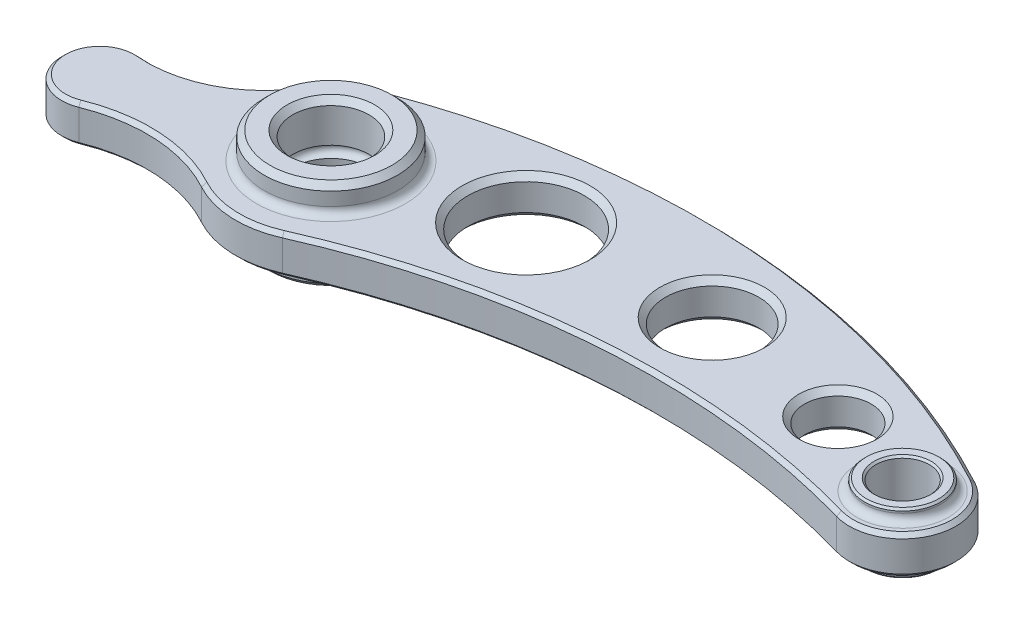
ISO-10303-21;
HEADER;
FILE_DESCRIPTION(('STEP AP214'),'2;1');
FILE_NAME('part.step','',(''),(''),'','','');
FILE_SCHEMA(('AUTOMOTIVE_DESIGN { 1 0 10303 214 1 1 1 1 }'));
ENDSEC;
DATA;
#1=APPLICATION_CONTEXT('core data for automotive mechanical design processes');
#2=APPLICATION_PROTOCOL_DEFINITION('international standard','automotive_design',2000,#1);
#3=PRODUCT_CONTEXT('',#1,'mechanical');
#4=PRODUCT('Part','Part','',(#3));
#5=PRODUCT_RELATED_PRODUCT_CATEGORY('part','',(#4));
#6=PRODUCT_DEFINITION_FORMATION('','',#4);
#7=PRODUCT_DEFINITION_CONTEXT('part definition',#1,'design');
#8=PRODUCT_DEFINITION('design','',#6,#7);
#9=PRODUCT_DEFINITION_SHAPE('','',#8);
#10=(LENGTH_UNIT() NAMED_UNIT(*) SI_UNIT(.MILLI.,.METRE.));
#11=(NAMED_UNIT(*) PLANE_ANGLE_UNIT() SI_UNIT($,.RADIAN.));
#12=(NAMED_UNIT(*) SI_UNIT($,.STERADIAN.) SOLID_ANGLE_UNIT());
#13=UNCERTAINTY_MEASURE_WITH_UNIT(LENGTH_MEASURE(1.E-05),#10,'distance_accuracy_value','');
#14=(GEOMETRIC_REPRESENTATION_CONTEXT(3) GLOBAL_UNCERTAINTY_ASSIGNED_CONTEXT((#13)) GLOBAL_UNIT_ASSIGNED_CONTEXT((#10,
#11,#12)) REPRESENTATION_CONTEXT('',''));
#15=CARTESIAN_POINT('',(0.,0.,0.));
#16=DIRECTION('',(0.,0.,1.));
#17=DIRECTION('',(1.,0.,0.));
#18=AXIS2_PLACEMENT_3D('',#15,#16,#17);
#19=CARTESIAN_POINT('',(0.,5.,0.));
#20=DIRECTION('',(0.,-1.,0.));
#21=DIRECTION('',(0.,0.,-1.));
#22=AXIS2_PLACEMENT_3D('',#19,#20,#21);
#23=CYLINDRICAL_SURFACE('',#22,10.);
#24=CARTESIAN_POINT('',(0.,-10.4999999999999,0.));
#25=DIRECTION('',(0.,1.,0.));
#26=DIRECTION('',(0.,0.,1.));
#27=AXIS2_PLACEMENT_3D('',#24,#25,#26);
#28=CIRCLE('',#27,10.);
#29=CARTESIAN_POINT('',(0.,-10.4999999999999,10.));
#30=VERTEX_POINT('',#29);
#31=EDGE_CURVE('E244',#30,#30,#28,.F.);
#32=ORIENTED_EDGE('',*,*,#31,.T.);
#33=EDGE_LOOP('',(#32));
#34=FACE_BOUND('',#33,.T.);
#35=CARTESIAN_POINT('',(0.,-1.50000000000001,0.));
#36=DIRECTION('',(0.,1.,0.));
#37=DIRECTION('',(0.,0.,1.));
#38=AXIS2_PLACEMENT_3D('',#35,#36,#37);
#39=CIRCLE('',#38,10.);
#40=CARTESIAN_POINT('',(0.,-1.50000000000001,10.));
#41=VERTEX_POINT('',#40);
#42=EDGE_CURVE('E189',#41,#41,#39,.T.);
#43=ORIENTED_EDGE('',*,*,#42,.T.);
#44=EDGE_LOOP('',(#43));
#45=FACE_BOUND('',#44,.T.);
#46=ADVANCED_FACE('F37',(#34,#45),#23,.F.);
#47=CARTESIAN_POINT('',(0.,10.5,0.));
#48=DIRECTION('',(0.,1.,0.));
#49=DIRECTION('',(0.,0.,1.));
#50=AXIS2_PLACEMENT_3D('',#47,#48,#49);
#51=CIRCLE('',#50,10.);
#52=CARTESIAN_POINT('',(0.,10.5,10.));
#53=VERTEX_POINT('',#52);
#54=EDGE_CURVE('E241',#53,#53,#51,.T.);
#55=ORIENTED_EDGE('',*,*,#54,.T.);
#56=EDGE_LOOP('',(#55));
#57=FACE_BOUND('',#56,.T.);
#58=CARTESIAN_POINT('',(0.,1.49999999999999,0.));
#59=DIRECTION('',(0.,-1.,0.));
#60=DIRECTION('',(0.,0.,-1.));
#61=AXIS2_PLACEMENT_3D('',#58,#59,#60);
#62=CIRCLE('',#61,10.);
#63=CARTESIAN_POINT('',(0.,1.49999999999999,-10.));
#64=VERTEX_POINT('',#63);
#65=EDGE_CURVE('E284',#64,#64,#62,.T.);
#66=ORIENTED_EDGE('',*,*,#65,.T.);
#67=EDGE_LOOP('',(#66));
#68=FACE_BOUND('',#67,.T.);
#69=ADVANCED_FACE('F332',(#57,#68),#23,.F.);
#70=CARTESIAN_POINT('',(120.548333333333,5.,102.866901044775));
#71=DIRECTION('',(0.,-1.,0.));
#72=DIRECTION('',(0.,0.,-1.));
#73=AXIS2_PLACEMENT_3D('',#70,#71,#72);
#74=PLANE('',#73);
#75=CARTESIAN_POINT('',(124.610444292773,5.,-8.40370314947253));
#76=DIRECTION('',(0.,-1.,0.));
#77=DIRECTION('',(0.,0.,-1.));
#78=AXIS2_PLACEMENT_3D('',#75,#76,#77);
#79=CIRCLE('',#78,10.2441912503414);
#80=CARTESIAN_POINT('',(124.610444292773,5.,-18.6478943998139));
#81=VERTEX_POINT('',#80);
#82=EDGE_CURVE('E309',#81,#81,#79,.T.);
#83=ORIENTED_EDGE('',*,*,#82,.T.);
#84=EDGE_LOOP('',(#83));
#85=FACE_BOUND('',#84,.T.);
#86=CARTESIAN_POINT('',(85.6003432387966,5.,-14.4358390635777));
#87=DIRECTION('',(0.,-1.,0.));
#88=DIRECTION('',(0.,0.,-1.));
#89=AXIS2_PLACEMENT_3D('',#86,#87,#88);
#90=CIRCLE('',#89,13.7382356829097);
#91=CARTESIAN_POINT('',(85.6003432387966,5.,-28.1740747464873));
#92=VERTEX_POINT('',#91);
#93=EDGE_CURVE('E306',#92,#92,#90,.T.);
#94=ORIENTED_EDGE('',*,*,#93,.T.);
#95=EDGE_LOOP('',(#94));
#96=FACE_BOUND('',#95,.T.);
#97=CARTESIAN_POINT('',(39.6539429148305,5.,-11.5664208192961));
#98=DIRECTION('',(0.,-1.,0.));
#99=DIRECTION('',(0.,0.,-1.));
#100=AXIS2_PLACEMENT_3D('',#97,#98,#99);
#101=CIRCLE('',#100,16.806383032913);
#102=CARTESIAN_POINT('',(39.6539429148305,5.,-28.3728038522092));
#103=VERTEX_POINT('',#102);
#104=EDGE_CURVE('E303',#103,#103,#101,.T.);
#105=ORIENTED_EDGE('',*,*,#104,.T.);
#106=EDGE_LOOP('',(#105));
#107=FACE_BOUND('',#106,.T.);
#108=CARTESIAN_POINT('',(150.,5.,0.));
#109=DIRECTION('',(0.,-1.,0.));
#110=DIRECTION('',(0.,0.,-1.));
#111=AXIS2_PLACEMENT_3D('',#108,#109,#110);
#112=CIRCLE('',#111,12.);
#113=CARTESIAN_POINT('',(150.,5.,-12.));
#114=VERTEX_POINT('',#113);
#115=EDGE_CURVE('E229',#114,#114,#112,.T.);
#116=ORIENTED_EDGE('',*,*,#115,.T.);
#117=EDGE_LOOP('',(#116));
#118=FACE_BOUND('',#117,.T.);
#119=CARTESIAN_POINT('',(0.,5.,0.));
#120=DIRECTION('',(0.,-1.,0.));
#121=DIRECTION('',(0.,0.,-1.));
#122=AXIS2_PLACEMENT_3D('',#119,#120,#121);
#123=CIRCLE('',#122,19.5);
#124=CARTESIAN_POINT('',(0.,5.,-19.5));
#125=VERTEX_POINT('',#124);
#126=EDGE_CURVE('E226',#125,#125,#123,.T.);
#127=ORIENTED_EDGE('',*,*,#126,.T.);
#128=EDGE_LOOP('',(#127));
#129=FACE_BOUND('',#128,.T.);
#130=CARTESIAN_POINT('',(-50.,5.,10.6278280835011));
#131=DIRECTION('',(0.,-1.,0.));
#132=DIRECTION('',(0.,0.,-1.));
#133=AXIS2_PLACEMENT_3D('',#130,#131,#132);
#134=CIRCLE('',#133,8.99999999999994);
#135=CARTESIAN_POINT('',(-49.2331632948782,5.,1.6605563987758));
#136=VERTEX_POINT('',#135);
#137=CARTESIAN_POINT('',(-46.628022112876,5.,18.972273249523));
#138=VERTEX_POINT('',#137);
#139=EDGE_CURVE('E1077',#136,#138,#134,.F.);
#140=ORIENTED_EDGE('',*,*,#139,.T.);
#141=CARTESIAN_POINT('',(-31.2667895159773,5.,56.9858567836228));
#142=DIRECTION('',(0.,-1.,0.));
#143=DIRECTION('',(0.,0.,-1.));
#144=AXIS2_PLACEMENT_3D('',#141,#142,#143);
#145=CIRCLE('',#144,41.0000000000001);
#146=CARTESIAN_POINT('',(-11.5446607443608,5.,21.0409317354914));
#147=VERTEX_POINT('',#146);
#148=EDGE_CURVE('E1081',#138,#147,#145,.T.);
#149=ORIENTED_EDGE('',*,*,#148,.T.);
#150=CARTESIAN_POINT('',(0.,5.,0.));
#151=DIRECTION('',(0.,-1.,0.));
#152=DIRECTION('',(0.,0.,-1.));
#153=AXIS2_PLACEMENT_3D('',#150,#151,#152);
#154=CIRCLE('',#153,23.9999999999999);
#155=CARTESIAN_POINT('',(9.71697777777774,5.,21.944938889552));
#156=VERTEX_POINT('',#155);
#157=EDGE_CURVE('E1079',#147,#156,#154,.F.);
#158=ORIENTED_EDGE('',*,*,#157,.T.);
#159=CARTESIAN_POINT('',(91.0966666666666,5.,205.73380208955));
#160=DIRECTION('',(0.,-1.,0.));
#161=DIRECTION('',(0.,0.,-1.));
#162=AXIS2_PLACEMENT_3D('',#159,#160,#161);
#163=CIRCLE('',#162,201.);
#164=CARTESIAN_POINT('',(146.421760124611,5.,12.4978477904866));
#165=VERTEX_POINT('',#164);
#166=EDGE_CURVE('E157',#156,#165,#163,.T.);
#167=ORIENTED_EDGE('',*,*,#166,.T.);
#168=CARTESIAN_POINT('',(150.,5.,0.));
#169=DIRECTION('',(0.,-1.,0.));
#170=DIRECTION('',(0.,0.,-1.));
#171=AXIS2_PLACEMENT_3D('',#168,#169,#170);
#172=CIRCLE('',#171,12.9999999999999);
#173=CARTESIAN_POINT('',(156.167078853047,5.,-11.4440874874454));
#174=VERTEX_POINT('',#173);
#175=EDGE_CURVE('E151',#165,#174,#172,.F.);
#176=ORIENTED_EDGE('',*,*,#175,.T.);
#177=CARTESIAN_POINT('',(61.7633333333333,5.,163.738482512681));
#178=DIRECTION('',(0.,-1.,0.));
#179=DIRECTION('',(0.,0.,-1.));
#180=AXIS2_PLACEMENT_3D('',#177,#178,#179);
#181=CIRCLE('',#180,199.);
#182=CARTESIAN_POINT('',(-8.47039999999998,5.,-22.4555633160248));
#183=VERTEX_POINT('',#182);
#184=EDGE_CURVE('E154',#174,#183,#181,.F.);
#185=ORIENTED_EDGE('',*,*,#184,.T.);
#186=CARTESIAN_POINT('',(0.,5.,0.));
#187=DIRECTION('',(0.,-1.,0.));
#188=DIRECTION('',(0.,0.,-1.));
#189=AXIS2_PLACEMENT_3D('',#186,#187,#188);
#190=CIRCLE('',#189,23.9999999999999);
#191=CARTESIAN_POINT('',(-20.3309833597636,5.,-12.7534746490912));
#192=VERTEX_POINT('',#191);
#193=EDGE_CURVE('E163',#183,#192,#190,.F.);
#194=ORIENTED_EDGE('',*,*,#193,.T.);
#195=CARTESIAN_POINT('',(-46.5918368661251,5.,-29.2267127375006));
#196=DIRECTION('',(0.,-1.,0.));
#197=DIRECTION('',(0.,0.,-1.));
#198=AXIS2_PLACEMENT_3D('',#195,#196,#197);
#199=CIRCLE('',#198,31.0000000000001);
#200=EDGE_CURVE('E162',#192,#136,#199,.T.);
#201=ORIENTED_EDGE('',*,*,#200,.T.);
#202=EDGE_LOOP('',(#140,#149,#158,#167,#176,#185,#194,#201));
#203=FACE_BOUND('',#202,.T.);
#204=ADVANCED_FACE('F153',(#85,#96,#107,#118,#129,#203),#74,.F.);
#205=CARTESIAN_POINT('',(120.548333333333,-5.,102.866901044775));
#206=DIRECTION('',(0.,-1.,0.));
#207=DIRECTION('',(0.,0.,-1.));
#208=AXIS2_PLACEMENT_3D('',#205,#206,#207);
#209=PLANE('',#208);
#210=CARTESIAN_POINT('',(124.610444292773,-5.,-8.40370314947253));
#211=DIRECTION('',(0.,-1.,0.));
#212=DIRECTION('',(0.,0.,-1.));
#213=AXIS2_PLACEMENT_3D('',#210,#211,#212);
#214=CIRCLE('',#213,10.2441912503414);
#215=CARTESIAN_POINT('',(124.610444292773,-5.,-18.647894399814));
#216=VERTEX_POINT('',#215);
#217=EDGE_CURVE('E294',#216,#216,#214,.F.);
#218=ORIENTED_EDGE('',*,*,#217,.T.);
#219=EDGE_LOOP('',(#218));
#220=FACE_BOUND('',#219,.T.);
#221=CARTESIAN_POINT('',(85.6003432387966,-5.,-14.4358390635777));
#222=DIRECTION('',(0.,-1.,0.));
#223=DIRECTION('',(0.,0.,-1.));
#224=AXIS2_PLACEMENT_3D('',#221,#222,#223);
#225=CIRCLE('',#224,13.7382356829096);
#226=CARTESIAN_POINT('',(85.6003432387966,-5.,-28.1740747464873));
#227=VERTEX_POINT('',#226);
#228=EDGE_CURVE('E291',#227,#227,#225,.F.);
#229=ORIENTED_EDGE('',*,*,#228,.T.);
#230=EDGE_LOOP('',(#229));
#231=FACE_BOUND('',#230,.T.);
#232=CARTESIAN_POINT('',(39.6539429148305,-5.,-11.5664208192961));
#233=DIRECTION('',(0.,-1.,0.));
#234=DIRECTION('',(0.,0.,-1.));
#235=AXIS2_PLACEMENT_3D('',#232,#233,#234);
#236=CIRCLE('',#235,16.806383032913);
#237=CARTESIAN_POINT('',(39.6539429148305,-5.,-28.3728038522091));
#238=VERTEX_POINT('',#237);
#239=EDGE_CURVE('E283',#238,#238,#236,.F.);
#240=ORIENTED_EDGE('',*,*,#239,.T.);
#241=EDGE_LOOP('',(#240));
#242=FACE_BOUND('',#241,.T.);
#243=CARTESIAN_POINT('',(150.,-5.,0.));
#244=DIRECTION('',(0.,-1.,0.));
#245=DIRECTION('',(0.,0.,-1.));
#246=AXIS2_PLACEMENT_3D('',#243,#244,#245);
#247=CIRCLE('',#246,12.);
#248=CARTESIAN_POINT('',(150.,-5.,-12.));
#249=VERTEX_POINT('',#248);
#250=EDGE_CURVE('E213',#249,#249,#247,.F.);
#251=ORIENTED_EDGE('',*,*,#250,.T.);
#252=EDGE_LOOP('',(#251));
#253=FACE_BOUND('',#252,.T.);
#254=CARTESIAN_POINT('',(0.,-5.,0.));
#255=DIRECTION('',(0.,-1.,0.));
#256=DIRECTION('',(0.,0.,-1.));
#257=AXIS2_PLACEMENT_3D('',#254,#255,#256);
#258=CIRCLE('',#257,19.5);
#259=CARTESIAN_POINT('',(0.,-5.,-19.5));
#260=VERTEX_POINT('',#259);
#261=EDGE_CURVE('E210',#260,#260,#258,.F.);
#262=ORIENTED_EDGE('',*,*,#261,.T.);
#263=EDGE_LOOP('',(#262));
#264=FACE_BOUND('',#263,.T.);
#265=CARTESIAN_POINT('',(0.,-5.,0.));
#266=DIRECTION('',(0.,-1.,0.));
#267=DIRECTION('',(0.,0.,-1.));
#268=AXIS2_PLACEMENT_3D('',#265,#266,#267);
#269=CIRCLE('',#268,24.);
#270=CARTESIAN_POINT('',(9.7169777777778,-5.,21.9449388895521));
#271=VERTEX_POINT('',#270);
#272=CARTESIAN_POINT('',(-11.5446607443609,-5.,21.0409317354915));
#273=VERTEX_POINT('',#272);
#274=EDGE_CURVE('E52',#271,#273,#269,.T.);
#275=ORIENTED_EDGE('',*,*,#274,.T.);
#276=CARTESIAN_POINT('',(-31.2667895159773,-5.,56.9858567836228));
#277=DIRECTION('',(0.,-1.,0.));
#278=DIRECTION('',(0.,0.,-1.));
#279=AXIS2_PLACEMENT_3D('',#276,#277,#278);
#280=CIRCLE('',#279,41.);
#281=CARTESIAN_POINT('',(-46.6280221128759,-5.,18.9722732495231));
#282=VERTEX_POINT('',#281);
#283=EDGE_CURVE('E214',#273,#282,#280,.F.);
#284=ORIENTED_EDGE('',*,*,#283,.T.);
#285=CARTESIAN_POINT('',(-50.,-5.,10.6278280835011));
#286=DIRECTION('',(0.,-1.,0.));
#287=DIRECTION('',(0.,0.,-1.));
#288=AXIS2_PLACEMENT_3D('',#285,#286,#287);
#289=CIRCLE('',#288,9.00000000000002);
#290=CARTESIAN_POINT('',(-49.2331632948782,-5.,1.66055639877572));
#291=VERTEX_POINT('',#290);
#292=EDGE_CURVE('E1003',#282,#291,#289,.T.);
#293=ORIENTED_EDGE('',*,*,#292,.T.);
#294=CARTESIAN_POINT('',(-46.5918368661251,-5.,-29.2267127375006));
#295=DIRECTION('',(0.,-1.,0.));
#296=DIRECTION('',(0.,0.,-1.));
#297=AXIS2_PLACEMENT_3D('',#294,#295,#296);
#298=CIRCLE('',#297,31.);
#299=CARTESIAN_POINT('',(-20.3309833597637,-5.,-12.7534746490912));
#300=VERTEX_POINT('',#299);
#301=EDGE_CURVE('E994',#291,#300,#298,.F.);
#302=ORIENTED_EDGE('',*,*,#301,.T.);
#303=CARTESIAN_POINT('',(0.,-5.,0.));
#304=DIRECTION('',(0.,-1.,0.));
#305=DIRECTION('',(0.,0.,-1.));
#306=AXIS2_PLACEMENT_3D('',#303,#304,#305);
#307=CIRCLE('',#306,24.);
#308=CARTESIAN_POINT('',(-8.47040000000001,-5.,-22.4555633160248));
#309=VERTEX_POINT('',#308);
#310=EDGE_CURVE('E995',#300,#309,#307,.T.);
#311=ORIENTED_EDGE('',*,*,#310,.T.);
#312=CARTESIAN_POINT('',(61.7633333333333,-5.,163.738482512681));
#313=DIRECTION('',(0.,-1.,0.));
#314=DIRECTION('',(0.,0.,-1.));
#315=AXIS2_PLACEMENT_3D('',#312,#313,#314);
#316=CIRCLE('',#315,199.);
#317=CARTESIAN_POINT('',(156.167078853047,-5.,-11.4440874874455));
#318=VERTEX_POINT('',#317);
#319=EDGE_CURVE('E988',#309,#318,#316,.T.);
#320=ORIENTED_EDGE('',*,*,#319,.T.);
#321=CARTESIAN_POINT('',(150.,-5.,0.));
#322=DIRECTION('',(0.,-1.,0.));
#323=DIRECTION('',(0.,0.,-1.));
#324=AXIS2_PLACEMENT_3D('',#321,#322,#323);
#325=CIRCLE('',#324,13.);
#326=CARTESIAN_POINT('',(146.421760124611,-5.,12.4978477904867));
#327=VERTEX_POINT('',#326);
#328=EDGE_CURVE('E992',#318,#327,#325,.T.);
#329=ORIENTED_EDGE('',*,*,#328,.T.);
#330=CARTESIAN_POINT('',(91.0966666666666,-5.,205.73380208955));
#331=DIRECTION('',(0.,-1.,0.));
#332=DIRECTION('',(0.,0.,-1.));
#333=AXIS2_PLACEMENT_3D('',#330,#331,#332);
#334=CIRCLE('',#333,201.);
#335=EDGE_CURVE('E997',#327,#271,#334,.F.);
#336=ORIENTED_EDGE('',*,*,#335,.T.);
#337=EDGE_LOOP('',(#275,#284,#293,#302,#311,#320,#329,#336));
#338=FACE_BOUND('',#337,.T.);
#339=ADVANCED_FACE('F346',(#220,#231,#242,#253,#264,#338),#209,.T.);
#340=CARTESIAN_POINT('',(91.0966666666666,5.,205.73380208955));
#341=DIRECTION('',(0.,-1.,0.));
#342=DIRECTION('',(0.,0.,-1.));
#343=AXIS2_PLACEMENT_3D('',#340,#341,#342);
#344=CYLINDRICAL_SURFACE('',#343,200.);
#345=DIRECTION('',(0.,-1.,0.));
#346=VECTOR('',#345,1.);
#347=CARTESIAN_POINT('',(146.146510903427,5.,13.4592206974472));
#348=LINE('',#347,#346);
#349=CARTESIAN_POINT('',(146.146510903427,3.99999999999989,13.4592206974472));
#350=VERTEX_POINT('',#349);
#351=CARTESIAN_POINT('',(146.146510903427,-4.,13.4592206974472));
#352=VERTEX_POINT('',#351);
#353=EDGE_CURVE('E174',#350,#352,#348,.T.);
#354=ORIENTED_EDGE('',*,*,#353,.F.);
#355=CARTESIAN_POINT('',(91.0966666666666,3.99999999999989,205.73380208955));
#356=DIRECTION('',(0.,-1.,0.));
#357=DIRECTION('',(0.,0.,-1.));
#358=AXIS2_PLACEMENT_3D('',#355,#356,#357);
#359=CIRCLE('',#358,200.);
#360=CARTESIAN_POINT('',(10.1218518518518,3.99999999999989,22.8593113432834));
#361=VERTEX_POINT('',#360);
#362=EDGE_CURVE('E1017',#350,#361,#359,.F.);
#363=ORIENTED_EDGE('',*,*,#362,.T.);
#364=DIRECTION('',(0.,-1.,0.));
#365=VECTOR('',#364,1.);
#366=CARTESIAN_POINT('',(10.1218518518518,5.,22.8593113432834));
#367=LINE('',#366,#365);
#368=CARTESIAN_POINT('',(10.1218518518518,-4.,22.8593113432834));
#369=VERTEX_POINT('',#368);
#370=EDGE_CURVE('E180',#361,#369,#367,.T.);
#371=ORIENTED_EDGE('',*,*,#370,.T.);
#372=CARTESIAN_POINT('',(91.0966666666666,-4.,205.73380208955));
#373=DIRECTION('',(0.,-1.,0.));
#374=DIRECTION('',(0.,0.,-1.));
#375=AXIS2_PLACEMENT_3D('',#372,#373,#374);
#376=CIRCLE('',#375,200.);
#377=EDGE_CURVE('E1023',#369,#352,#376,.T.);
#378=ORIENTED_EDGE('',*,*,#377,.T.);
#379=EDGE_LOOP('',(#354,#363,#371,#378));
#380=FACE_BOUND('',#379,.T.);
#381=ADVANCED_FACE('F350',(#380),#344,.F.);
#382=CARTESIAN_POINT('',(150.,5.,0.));
#383=DIRECTION('',(0.,-1.,0.));
#384=DIRECTION('',(0.,0.,-1.));
#385=AXIS2_PLACEMENT_3D('',#382,#383,#384);
#386=CYLINDRICAL_SURFACE('',#385,14.);
#387=DIRECTION('',(0.,-1.,0.));
#388=VECTOR('',#387,1.);
#389=CARTESIAN_POINT('',(156.64146953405,5.,-12.3244019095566));
#390=LINE('',#389,#388);
#391=CARTESIAN_POINT('',(156.64146953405,3.99999999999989,-12.3244019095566));
#392=VERTEX_POINT('',#391);
#393=CARTESIAN_POINT('',(156.64146953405,-4.,-12.3244019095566));
#394=VERTEX_POINT('',#393);
#395=EDGE_CURVE('E1069',#392,#394,#390,.T.);
#396=ORIENTED_EDGE('',*,*,#395,.F.);
#397=CARTESIAN_POINT('',(150.,3.99999999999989,0.));
#398=DIRECTION('',(0.,-1.,0.));
#399=DIRECTION('',(0.,0.,-1.));
#400=AXIS2_PLACEMENT_3D('',#397,#398,#399);
#401=CIRCLE('',#400,14.);
#402=EDGE_CURVE('E177',#392,#350,#401,.T.);
#403=ORIENTED_EDGE('',*,*,#402,.T.);
#404=ORIENTED_EDGE('',*,*,#353,.T.);
#405=CARTESIAN_POINT('',(150.,-4.,0.));
#406=DIRECTION('',(0.,-1.,0.));
#407=DIRECTION('',(0.,0.,-1.));
#408=AXIS2_PLACEMENT_3D('',#405,#406,#407);
#409=CIRCLE('',#408,14.);
#410=EDGE_CURVE('E1032',#352,#394,#409,.F.);
#411=ORIENTED_EDGE('',*,*,#410,.T.);
#412=EDGE_LOOP('',(#396,#403,#404,#411));
#413=FACE_BOUND('',#412,.T.);
#414=ADVANCED_FACE('F375',(#413),#386,.T.);
#415=CARTESIAN_POINT('',(61.7633333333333,5.,163.738482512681));
#416=DIRECTION('',(0.,-1.,0.));
#417=DIRECTION('',(0.,0.,-1.));
#418=AXIS2_PLACEMENT_3D('',#415,#416,#417);
#419=CYLINDRICAL_SURFACE('',#418,200.);
#420=DIRECTION('',(0.,-1.,0.));
#421=VECTOR('',#420,1.);
#422=CARTESIAN_POINT('',(-8.82333333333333,5.,-23.3912117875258));
#423=LINE('',#422,#421);
#424=CARTESIAN_POINT('',(-8.82333333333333,3.99999999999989,-23.3912117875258));
#425=VERTEX_POINT('',#424);
#426=CARTESIAN_POINT('',(-8.82333333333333,-4.,-23.3912117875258));
#427=VERTEX_POINT('',#426);
#428=EDGE_CURVE('E1061',#425,#427,#423,.T.);
#429=ORIENTED_EDGE('',*,*,#428,.F.);
#430=CARTESIAN_POINT('',(61.7633333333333,3.99999999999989,163.738482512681));
#431=DIRECTION('',(0.,-1.,0.));
#432=DIRECTION('',(0.,0.,-1.));
#433=AXIS2_PLACEMENT_3D('',#430,#431,#432);
#434=CIRCLE('',#433,200.);
#435=EDGE_CURVE('E1040',#425,#392,#434,.T.);
#436=ORIENTED_EDGE('',*,*,#435,.T.);
#437=ORIENTED_EDGE('',*,*,#395,.T.);
#438=CARTESIAN_POINT('',(61.7633333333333,-4.,163.738482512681));
#439=DIRECTION('',(0.,-1.,0.));
#440=DIRECTION('',(0.,0.,-1.));
#441=AXIS2_PLACEMENT_3D('',#438,#439,#440);
#442=CIRCLE('',#441,200.);
#443=EDGE_CURVE('E989',#394,#427,#442,.F.);
#444=ORIENTED_EDGE('',*,*,#443,.T.);
#445=EDGE_LOOP('',(#429,#436,#437,#444));
#446=FACE_BOUND('',#445,.T.);
#447=ADVANCED_FACE('F371',(#446),#419,.T.);
#448=CARTESIAN_POINT('',(0.,5.,0.));
#449=DIRECTION('',(0.,-1.,0.));
#450=DIRECTION('',(0.,0.,-1.));
#451=AXIS2_PLACEMENT_3D('',#448,#449,#450);
#452=CYLINDRICAL_SURFACE('',#451,25.);
#453=DIRECTION('',(0.,-1.,0.));
#454=VECTOR('',#453,1.);
#455=CARTESIAN_POINT('',(-21.1781076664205,5.,-13.2848694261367));
#456=LINE('',#455,#454);
#457=CARTESIAN_POINT('',(-21.1781076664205,3.99999999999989,-13.2848694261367));
#458=VERTEX_POINT('',#457);
#459=CARTESIAN_POINT('',(-21.1781076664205,-4.,-13.2848694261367));
#460=VERTEX_POINT('',#459);
#461=EDGE_CURVE('E1054',#458,#460,#456,.T.);
#462=ORIENTED_EDGE('',*,*,#461,.F.);
#463=CARTESIAN_POINT('',(0.,3.99999999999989,0.));
#464=DIRECTION('',(0.,-1.,0.));
#465=DIRECTION('',(0.,0.,-1.));
#466=AXIS2_PLACEMENT_3D('',#463,#464,#465);
#467=CIRCLE('',#466,25.);
#468=EDGE_CURVE('E1037',#458,#425,#467,.T.);
#469=ORIENTED_EDGE('',*,*,#468,.T.);
#470=ORIENTED_EDGE('',*,*,#428,.T.);
#471=CARTESIAN_POINT('',(0.,-4.,0.));
#472=DIRECTION('',(0.,-1.,0.));
#473=DIRECTION('',(0.,0.,-1.));
#474=AXIS2_PLACEMENT_3D('',#471,#472,#473);
#475=CIRCLE('',#474,25.);
#476=EDGE_CURVE('E1035',#427,#460,#475,.F.);
#477=ORIENTED_EDGE('',*,*,#476,.T.);
#478=EDGE_LOOP('',(#462,#469,#470,#477));
#479=FACE_BOUND('',#478,.T.);
#480=ADVANCED_FACE('F367',(#479),#452,.T.);
#481=CARTESIAN_POINT('',(-46.5918368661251,5.,-29.2267127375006));
#482=DIRECTION('',(0.,-1.,0.));
#483=DIRECTION('',(0.,0.,-1.));
#484=AXIS2_PLACEMENT_3D('',#481,#482,#483);
#485=CYLINDRICAL_SURFACE('',#484,30.);
#486=DIRECTION('',(0.,-1.,0.));
#487=VECTOR('',#486,1.);
#488=CARTESIAN_POINT('',(-49.1479592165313,5.,0.664192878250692));
#489=LINE('',#488,#487);
#490=CARTESIAN_POINT('',(-49.1479592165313,3.99999999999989,0.664192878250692));
#491=VERTEX_POINT('',#490);
#492=CARTESIAN_POINT('',(-49.1479592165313,-4.,0.664192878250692));
#493=VERTEX_POINT('',#492);
#494=EDGE_CURVE('E1051',#491,#493,#489,.T.);
#495=ORIENTED_EDGE('',*,*,#494,.F.);
#496=CARTESIAN_POINT('',(-46.5918368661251,3.99999999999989,-29.2267127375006));
#497=DIRECTION('',(0.,-1.,0.));
#498=DIRECTION('',(0.,0.,-1.));
#499=AXIS2_PLACEMENT_3D('',#496,#497,#498);
#500=CIRCLE('',#499,30.);
#501=EDGE_CURVE('E1025',#491,#458,#500,.F.);
#502=ORIENTED_EDGE('',*,*,#501,.T.);
#503=ORIENTED_EDGE('',*,*,#461,.T.);
#504=CARTESIAN_POINT('',(-46.5918368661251,-4.,-29.2267127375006));
#505=DIRECTION('',(0.,-1.,0.));
#506=DIRECTION('',(0.,0.,-1.));
#507=AXIS2_PLACEMENT_3D('',#504,#505,#506);
#508=CIRCLE('',#507,30.);
#509=EDGE_CURVE('E1022',#460,#493,#508,.T.);
#510=ORIENTED_EDGE('',*,*,#509,.T.);
#511=EDGE_LOOP('',(#495,#502,#503,#510));
#512=FACE_BOUND('',#511,.T.);
#513=ADVANCED_FACE('F363',(#512),#485,.F.);
#514=CARTESIAN_POINT('',(-50.,5.,10.6278280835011));
#515=DIRECTION('',(0.,-1.,0.));
#516=DIRECTION('',(0.,0.,-1.));
#517=AXIS2_PLACEMENT_3D('',#514,#515,#516);
#518=CYLINDRICAL_SURFACE('',#517,10.);
#519=DIRECTION('',(0.,-1.,0.));
#520=VECTOR('',#519,1.);
#521=CARTESIAN_POINT('',(-46.2533579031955,5.,19.8994338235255));
#522=LINE('',#521,#520);
#523=CARTESIAN_POINT('',(-46.2533579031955,3.99999999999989,19.8994338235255));
#524=VERTEX_POINT('',#523);
#525=CARTESIAN_POINT('',(-46.2533579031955,-4.,19.8994338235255));
#526=VERTEX_POINT('',#525);
#527=EDGE_CURVE('E1059',#524,#526,#522,.T.);
#528=ORIENTED_EDGE('',*,*,#527,.F.);
#529=CARTESIAN_POINT('',(-50.,3.99999999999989,10.6278280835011));
#530=DIRECTION('',(0.,-1.,0.));
#531=DIRECTION('',(0.,0.,-1.));
#532=AXIS2_PLACEMENT_3D('',#529,#530,#531);
#533=CIRCLE('',#532,10.);
#534=EDGE_CURVE('E1027',#524,#491,#533,.T.);
#535=ORIENTED_EDGE('',*,*,#534,.T.);
#536=ORIENTED_EDGE('',*,*,#494,.T.);
#537=CARTESIAN_POINT('',(-50.,-4.,10.6278280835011));
#538=DIRECTION('',(0.,-1.,0.));
#539=DIRECTION('',(0.,0.,-1.));
#540=AXIS2_PLACEMENT_3D('',#537,#538,#539);
#541=CIRCLE('',#540,10.);
#542=EDGE_CURVE('E1056',#493,#526,#541,.F.);
#543=ORIENTED_EDGE('',*,*,#542,.T.);
#544=EDGE_LOOP('',(#528,#535,#536,#543));
#545=FACE_BOUND('',#544,.T.);
#546=ADVANCED_FACE('F359',(#545),#518,.T.);
#547=CARTESIAN_POINT('',(-31.2667895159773,5.,56.9858567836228));
#548=DIRECTION('',(0.,-1.,0.));
#549=DIRECTION('',(0.,0.,-1.));
#550=AXIS2_PLACEMENT_3D('',#547,#548,#549);
#551=CYLINDRICAL_SURFACE('',#550,40.);
#552=DIRECTION('',(0.,-1.,0.));
#553=VECTOR('',#552,1.);
#554=CARTESIAN_POINT('',(-12.0256882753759,5.,21.9176372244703));
#555=LINE('',#554,#553);
#556=CARTESIAN_POINT('',(-12.0256882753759,3.99999999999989,21.9176372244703));
#557=VERTEX_POINT('',#556);
#558=CARTESIAN_POINT('',(-12.0256882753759,-4.,21.9176372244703));
#559=VERTEX_POINT('',#558);
#560=EDGE_CURVE('E1063',#557,#559,#555,.T.);
#561=ORIENTED_EDGE('',*,*,#560,.F.);
#562=CARTESIAN_POINT('',(-31.2667895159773,3.99999999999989,56.9858567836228));
#563=DIRECTION('',(0.,-1.,0.));
#564=DIRECTION('',(0.,0.,-1.));
#565=AXIS2_PLACEMENT_3D('',#562,#563,#564);
#566=CIRCLE('',#565,40.);
#567=EDGE_CURVE('E1087',#557,#524,#566,.F.);
#568=ORIENTED_EDGE('',*,*,#567,.T.);
#569=ORIENTED_EDGE('',*,*,#527,.T.);
#570=CARTESIAN_POINT('',(-31.2667895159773,-4.,56.9858567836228));
#571=DIRECTION('',(0.,-1.,0.));
#572=DIRECTION('',(0.,0.,-1.));
#573=AXIS2_PLACEMENT_3D('',#570,#571,#572);
#574=CIRCLE('',#573,40.);
#575=EDGE_CURVE('E1084',#526,#559,#574,.T.);
#576=ORIENTED_EDGE('',*,*,#575,.T.);
#577=EDGE_LOOP('',(#561,#568,#569,#576));
#578=FACE_BOUND('',#577,.T.);
#579=ADVANCED_FACE('F355',(#578),#551,.F.);
#580=CARTESIAN_POINT('',(0.,5.,0.));
#581=DIRECTION('',(0.,-1.,0.));
#582=DIRECTION('',(0.,0.,-1.));
#583=AXIS2_PLACEMENT_3D('',#580,#581,#582);
#584=CYLINDRICAL_SURFACE('',#583,25.);
#585=ORIENTED_EDGE('',*,*,#370,.F.);
#586=CARTESIAN_POINT('',(0.,3.99999999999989,0.));
#587=DIRECTION('',(0.,-1.,0.));
#588=DIRECTION('',(0.,0.,-1.));
#589=AXIS2_PLACEMENT_3D('',#586,#587,#588);
#590=CIRCLE('',#589,25.);
#591=EDGE_CURVE('E1092',#361,#557,#590,.T.);
#592=ORIENTED_EDGE('',*,*,#591,.T.);
#593=ORIENTED_EDGE('',*,*,#560,.T.);
#594=CARTESIAN_POINT('',(0.,-4.,0.));
#595=DIRECTION('',(0.,-1.,0.));
#596=DIRECTION('',(0.,0.,-1.));
#597=AXIS2_PLACEMENT_3D('',#594,#595,#596);
#598=CIRCLE('',#597,25.);
#599=EDGE_CURVE('E1090',#559,#369,#598,.F.);
#600=ORIENTED_EDGE('',*,*,#599,.T.);
#601=EDGE_LOOP('',(#585,#592,#593,#600));
#602=FACE_BOUND('',#601,.T.);
#603=ADVANCED_FACE('F352',(#602),#584,.T.);
#604=CARTESIAN_POINT('',(39.6539429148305,5.,-11.5664208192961));
#605=DIRECTION('',(0.,-1.,0.));
#606=DIRECTION('',(0.,0.,-1.));
#607=AXIS2_PLACEMENT_3D('',#604,#605,#606);
#608=CYLINDRICAL_SURFACE('',#607,15.306383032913);
#609=CARTESIAN_POINT('',(39.6539429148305,-3.50000000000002,-11.5664208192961));
#610=DIRECTION('',(0.,-1.,0.));
#611=DIRECTION('',(0.,0.,-1.));
#612=AXIS2_PLACEMENT_3D('',#609,#610,#611);
#613=CIRCLE('',#612,15.306383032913);
#614=CARTESIAN_POINT('',(39.6539429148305,-3.50000000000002,-26.8728038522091));
#615=VERTEX_POINT('',#614);
#616=EDGE_CURVE('E11',#615,#615,#613,.T.);
#617=ORIENTED_EDGE('',*,*,#616,.T.);
#618=EDGE_LOOP('',(#617));
#619=FACE_BOUND('',#618,.T.);
#620=CARTESIAN_POINT('',(39.6539429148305,3.49999999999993,-11.5664208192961));
#621=DIRECTION('',(0.,-1.,0.));
#622=DIRECTION('',(0.,0.,-1.));
#623=AXIS2_PLACEMENT_3D('',#620,#621,#622);
#624=CIRCLE('',#623,15.306383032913);
#625=CARTESIAN_POINT('',(39.6539429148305,3.49999999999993,-26.8728038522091));
#626=VERTEX_POINT('',#625);
#627=EDGE_CURVE('E45',#626,#626,#624,.F.);
#628=ORIENTED_EDGE('',*,*,#627,.T.);
#629=EDGE_LOOP('',(#628));
#630=FACE_BOUND('',#629,.T.);
#631=ADVANCED_FACE('F320',(#619,#630),#608,.F.);
#632=CARTESIAN_POINT('',(124.610444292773,5.,-8.40370314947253));
#633=DIRECTION('',(0.,-1.,0.));
#634=DIRECTION('',(0.,0.,-1.));
#635=AXIS2_PLACEMENT_3D('',#632,#633,#634);
#636=CYLINDRICAL_SURFACE('',#635,8.74419125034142);
#637=CARTESIAN_POINT('',(124.610444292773,-3.49999999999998,-8.40370314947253));
#638=DIRECTION('',(0.,-1.,0.));
#639=DIRECTION('',(0.,0.,-1.));
#640=AXIS2_PLACEMENT_3D('',#637,#638,#639);
#641=CIRCLE('',#640,8.74419125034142);
#642=CARTESIAN_POINT('',(124.610444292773,-3.49999999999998,-17.1478943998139));
#643=VERTEX_POINT('',#642);
#644=EDGE_CURVE('E300',#643,#643,#641,.T.);
#645=ORIENTED_EDGE('',*,*,#644,.T.);
#646=EDGE_LOOP('',(#645));
#647=FACE_BOUND('',#646,.T.);
#648=CARTESIAN_POINT('',(124.610444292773,3.50000000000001,-8.40370314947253));
#649=DIRECTION('',(0.,-1.,0.));
#650=DIRECTION('',(0.,0.,-1.));
#651=AXIS2_PLACEMENT_3D('',#648,#649,#650);
#652=CIRCLE('',#651,8.74419125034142);
#653=CARTESIAN_POINT('',(124.610444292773,3.50000000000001,-17.1478943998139));
#654=VERTEX_POINT('',#653);
#655=EDGE_CURVE('E297',#654,#654,#652,.F.);
#656=ORIENTED_EDGE('',*,*,#655,.T.);
#657=EDGE_LOOP('',(#656));
#658=FACE_BOUND('',#657,.T.);
#659=ADVANCED_FACE('F515',(#647,#658),#636,.F.);
#660=CARTESIAN_POINT('',(85.6003432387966,5.,-14.4358390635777));
#661=DIRECTION('',(0.,-1.,0.));
#662=DIRECTION('',(0.,0.,-1.));
#663=AXIS2_PLACEMENT_3D('',#660,#661,#662);
#664=CYLINDRICAL_SURFACE('',#663,12.2382356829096);
#665=CARTESIAN_POINT('',(85.6003432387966,-3.49999999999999,-14.4358390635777));
#666=DIRECTION('',(0.,-1.,0.));
#667=DIRECTION('',(0.,0.,-1.));
#668=AXIS2_PLACEMENT_3D('',#665,#666,#667);
#669=CIRCLE('',#668,12.2382356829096);
#670=CARTESIAN_POINT('',(85.6003432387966,-3.49999999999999,-26.6740747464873));
#671=VERTEX_POINT('',#670);
#672=EDGE_CURVE('E315',#671,#671,#669,.T.);
#673=ORIENTED_EDGE('',*,*,#672,.T.);
#674=EDGE_LOOP('',(#673));
#675=FACE_BOUND('',#674,.T.);
#676=CARTESIAN_POINT('',(85.6003432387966,3.49999999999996,-14.4358390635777));
#677=DIRECTION('',(0.,-1.,0.));
#678=DIRECTION('',(0.,0.,-1.));
#679=AXIS2_PLACEMENT_3D('',#676,#677,#678);
#680=CIRCLE('',#679,12.2382356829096);
#681=CARTESIAN_POINT('',(85.6003432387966,3.49999999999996,-26.6740747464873));
#682=VERTEX_POINT('',#681);
#683=EDGE_CURVE('E312',#682,#682,#680,.F.);
#684=ORIENTED_EDGE('',*,*,#683,.T.);
#685=EDGE_LOOP('',(#684));
#686=FACE_BOUND('',#685,.T.);
#687=ADVANCED_FACE('F512',(#675,#686),#664,.F.);
#688=CARTESIAN_POINT('',(0.,12.,0.));
#689=DIRECTION('',(0.,-1.,0.));
#690=DIRECTION('',(0.,0.,-1.));
#691=AXIS2_PLACEMENT_3D('',#688,#689,#690);
#692=CYLINDRICAL_SURFACE('',#691,17.5);
#693=CARTESIAN_POINT('',(0.,-10.5,0.));
#694=DIRECTION('',(0.,1.,0.));
#695=DIRECTION('',(0.,0.,1.));
#696=AXIS2_PLACEMENT_3D('',#693,#694,#695);
#697=CIRCLE('',#696,17.5);
#698=CARTESIAN_POINT('',(0.,-10.5,17.5));
#699=VERTEX_POINT('',#698);
#700=EDGE_CURVE('E247',#699,#699,#697,.T.);
#701=ORIENTED_EDGE('',*,*,#700,.T.);
#702=EDGE_LOOP('',(#701));
#703=FACE_BOUND('',#702,.T.);
#704=CARTESIAN_POINT('',(0.,-7.,0.));
#705=DIRECTION('',(0.,-1.,0.));
#706=DIRECTION('',(0.,0.,-1.));
#707=AXIS2_PLACEMENT_3D('',#704,#705,#706);
#708=CIRCLE('',#707,17.5);
#709=CARTESIAN_POINT('',(0.,-7.,-17.5));
#710=VERTEX_POINT('',#709);
#711=EDGE_CURVE('E220',#710,#710,#708,.T.);
#712=ORIENTED_EDGE('',*,*,#711,.T.);
#713=EDGE_LOOP('',(#712));
#714=FACE_BOUND('',#713,.T.);
#715=ADVANCED_FACE('F514',(#703,#714),#692,.T.);
#716=CARTESIAN_POINT('',(0.,-12.,0.));
#717=DIRECTION('',(0.,1.,0.));
#718=DIRECTION('',(0.,0.,1.));
#719=AXIS2_PLACEMENT_3D('',#716,#717,#718);
#720=PLANE('',#719);
#721=CARTESIAN_POINT('',(0.,-12.,0.));
#722=DIRECTION('',(0.,1.,0.));
#723=DIRECTION('',(0.,0.,1.));
#724=AXIS2_PLACEMENT_3D('',#721,#722,#723);
#725=CIRCLE('',#724,11.5000000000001);
#726=CARTESIAN_POINT('',(0.,-12.,11.5000000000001));
#727=VERTEX_POINT('',#726);
#728=EDGE_CURVE('E238',#727,#727,#725,.T.);
#729=ORIENTED_EDGE('',*,*,#728,.T.);
#730=EDGE_LOOP('',(#729));
#731=FACE_BOUND('',#730,.T.);
#732=CARTESIAN_POINT('',(0.,-12.,0.));
#733=DIRECTION('',(0.,1.,0.));
#734=DIRECTION('',(0.,0.,1.));
#735=AXIS2_PLACEMENT_3D('',#732,#733,#734);
#736=CIRCLE('',#735,16.);
#737=CARTESIAN_POINT('',(0.,-12.,16.));
#738=VERTEX_POINT('',#737);
#739=EDGE_CURVE('E235',#738,#738,#736,.F.);
#740=ORIENTED_EDGE('',*,*,#739,.T.);
#741=EDGE_LOOP('',(#740));
#742=FACE_BOUND('',#741,.T.);
#743=ADVANCED_FACE('F522',(#731,#742),#720,.F.);
#744=CARTESIAN_POINT('',(0.,10.5,0.));
#745=DIRECTION('',(0.,1.,0.));
#746=DIRECTION('',(0.,0.,1.));
#747=AXIS2_PLACEMENT_3D('',#744,#745,#746);
#748=CIRCLE('',#747,17.5);
#749=CARTESIAN_POINT('',(0.,10.5,17.5));
#750=VERTEX_POINT('',#749);
#751=EDGE_CURVE('E256',#750,#750,#748,.F.);
#752=ORIENTED_EDGE('',*,*,#751,.T.);
#753=EDGE_LOOP('',(#752));
#754=FACE_BOUND('',#753,.T.);
#755=CARTESIAN_POINT('',(0.,7.,0.));
#756=DIRECTION('',(0.,-1.,0.));
#757=DIRECTION('',(0.,0.,-1.));
#758=AXIS2_PLACEMENT_3D('',#755,#756,#757);
#759=CIRCLE('',#758,17.5);
#760=CARTESIAN_POINT('',(0.,7.,-17.5));
#761=VERTEX_POINT('',#760);
#762=EDGE_CURVE('E232',#761,#761,#759,.F.);
#763=ORIENTED_EDGE('',*,*,#762,.T.);
#764=EDGE_LOOP('',(#763));
#765=FACE_BOUND('',#764,.T.);
#766=ADVANCED_FACE('F525',(#754,#765),#692,.T.);
#767=CARTESIAN_POINT('',(0.,12.,0.));
#768=DIRECTION('',(0.,1.,0.));
#769=DIRECTION('',(0.,0.,1.));
#770=AXIS2_PLACEMENT_3D('',#767,#768,#769);
#771=PLANE('',#770);
#772=CARTESIAN_POINT('',(0.,12.,0.));
#773=DIRECTION('',(0.,1.,0.));
#774=DIRECTION('',(0.,0.,1.));
#775=AXIS2_PLACEMENT_3D('',#772,#773,#774);
#776=CIRCLE('',#775,11.5000000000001);
#777=CARTESIAN_POINT('',(0.,12.,11.5000000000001));
#778=VERTEX_POINT('',#777);
#779=EDGE_CURVE('E253',#778,#778,#776,.F.);
#780=ORIENTED_EDGE('',*,*,#779,.T.);
#781=EDGE_LOOP('',(#780));
#782=FACE_BOUND('',#781,.T.);
#783=CARTESIAN_POINT('',(0.,12.,0.));
#784=DIRECTION('',(0.,1.,0.));
#785=DIRECTION('',(0.,0.,1.));
#786=AXIS2_PLACEMENT_3D('',#783,#784,#785);
#787=CIRCLE('',#786,16.);
#788=CARTESIAN_POINT('',(0.,12.,16.));
#789=VERTEX_POINT('',#788);
#790=EDGE_CURVE('E250',#789,#789,#787,.T.);
#791=ORIENTED_EDGE('',*,*,#790,.T.);
#792=EDGE_LOOP('',(#791));
#793=FACE_BOUND('',#792,.T.);
#794=ADVANCED_FACE('F748',(#782,#793),#771,.T.);
#795=CARTESIAN_POINT('',(150.,8.,0.));
#796=DIRECTION('',(0.,-1.,0.));
#797=DIRECTION('',(0.,0.,-1.));
#798=AXIS2_PLACEMENT_3D('',#795,#796,#797);
#799=CYLINDRICAL_SURFACE('',#798,10.);
#800=CARTESIAN_POINT('',(150.,-7.49999999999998,0.));
#801=DIRECTION('',(0.,1.,0.));
#802=DIRECTION('',(0.,0.,1.));
#803=AXIS2_PLACEMENT_3D('',#800,#801,#802);
#804=CIRCLE('',#803,10.);
#805=CARTESIAN_POINT('',(150.,-7.49999999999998,10.));
#806=VERTEX_POINT('',#805);
#807=EDGE_CURVE('E271',#806,#806,#804,.T.);
#808=ORIENTED_EDGE('',*,*,#807,.T.);
#809=EDGE_LOOP('',(#808));
#810=FACE_BOUND('',#809,.T.);
#811=CARTESIAN_POINT('',(150.,-7.,0.));
#812=DIRECTION('',(0.,-1.,0.));
#813=DIRECTION('',(0.,0.,-1.));
#814=AXIS2_PLACEMENT_3D('',#811,#812,#813);
#815=CIRCLE('',#814,10.);
#816=CARTESIAN_POINT('',(150.,-7.,-10.));
#817=VERTEX_POINT('',#816);
#818=EDGE_CURVE('E217',#817,#817,#815,.T.);
#819=ORIENTED_EDGE('',*,*,#818,.T.);
#820=EDGE_LOOP('',(#819));
#821=FACE_BOUND('',#820,.T.);
#822=ADVANCED_FACE('F729',(#810,#821),#799,.T.);
#823=CARTESIAN_POINT('',(150.,-8.,0.));
#824=DIRECTION('',(0.,1.,0.));
#825=DIRECTION('',(0.,0.,1.));
#826=AXIS2_PLACEMENT_3D('',#823,#824,#825);
#827=PLANE('',#826);
#828=CARTESIAN_POINT('',(150.,-8.,0.));
#829=DIRECTION('',(0.,1.,0.));
#830=DIRECTION('',(0.,0.,1.));
#831=AXIS2_PLACEMENT_3D('',#828,#829,#830);
#832=CIRCLE('',#831,7.49999999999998);
#833=CARTESIAN_POINT('',(150.,-8.,7.49999999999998));
#834=VERTEX_POINT('',#833);
#835=EDGE_CURVE('E262',#834,#834,#832,.T.);
#836=ORIENTED_EDGE('',*,*,#835,.T.);
#837=EDGE_LOOP('',(#836));
#838=FACE_BOUND('',#837,.T.);
#839=CARTESIAN_POINT('',(150.,-8.,0.));
#840=DIRECTION('',(0.,1.,0.));
#841=DIRECTION('',(0.,0.,1.));
#842=AXIS2_PLACEMENT_3D('',#839,#840,#841);
#843=CIRCLE('',#842,9.49999999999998);
#844=CARTESIAN_POINT('',(150.,-8.,9.49999999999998));
#845=VERTEX_POINT('',#844);
#846=EDGE_CURVE('E259',#845,#845,#843,.F.);
#847=ORIENTED_EDGE('',*,*,#846,.T.);
#848=EDGE_LOOP('',(#847));
#849=FACE_BOUND('',#848,.T.);
#850=ADVANCED_FACE('F735',(#838,#849),#827,.F.);
#851=CARTESIAN_POINT('',(150.,5.,0.));
#852=DIRECTION('',(0.,-1.,0.));
#853=DIRECTION('',(0.,0.,-1.));
#854=AXIS2_PLACEMENT_3D('',#851,#852,#853);
#855=CYLINDRICAL_SURFACE('',#854,7.00000000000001);
#856=CARTESIAN_POINT('',(150.,-7.50000000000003,0.));
#857=DIRECTION('',(0.,1.,0.));
#858=DIRECTION('',(0.,0.,1.));
#859=AXIS2_PLACEMENT_3D('',#856,#857,#858);
#860=CIRCLE('',#859,7.00000000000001);
#861=CARTESIAN_POINT('',(150.,-7.50000000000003,7.00000000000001));
#862=VERTEX_POINT('',#861);
#863=EDGE_CURVE('E268',#862,#862,#860,.F.);
#864=ORIENTED_EDGE('',*,*,#863,.T.);
#865=EDGE_LOOP('',(#864));
#866=FACE_BOUND('',#865,.T.);
#867=CARTESIAN_POINT('',(150.,7.49999999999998,0.));
#868=DIRECTION('',(0.,1.,0.));
#869=DIRECTION('',(0.,0.,1.));
#870=AXIS2_PLACEMENT_3D('',#867,#868,#869);
#871=CIRCLE('',#870,7.00000000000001);
#872=CARTESIAN_POINT('',(150.,7.49999999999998,7.00000000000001));
#873=VERTEX_POINT('',#872);
#874=EDGE_CURVE('E265',#873,#873,#871,.T.);
#875=ORIENTED_EDGE('',*,*,#874,.T.);
#876=EDGE_LOOP('',(#875));
#877=FACE_BOUND('',#876,.T.);
#878=ADVANCED_FACE('F342',(#866,#877),#855,.F.);
#879=CARTESIAN_POINT('',(150.,7.49999999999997,0.));
#880=DIRECTION('',(0.,1.,0.));
#881=DIRECTION('',(0.,0.,1.));
#882=AXIS2_PLACEMENT_3D('',#879,#880,#881);
#883=CIRCLE('',#882,10.);
#884=CARTESIAN_POINT('',(150.,7.49999999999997,10.));
#885=VERTEX_POINT('',#884);
#886=EDGE_CURVE('E280',#885,#885,#883,.F.);
#887=ORIENTED_EDGE('',*,*,#886,.T.);
#888=EDGE_LOOP('',(#887));
#889=FACE_BOUND('',#888,.T.);
#890=CARTESIAN_POINT('',(150.,7.,0.));
#891=DIRECTION('',(0.,-1.,0.));
#892=DIRECTION('',(0.,0.,-1.));
#893=AXIS2_PLACEMENT_3D('',#890,#891,#892);
#894=CIRCLE('',#893,10.);
#895=CARTESIAN_POINT('',(150.,7.,-10.));
#896=VERTEX_POINT('',#895);
#897=EDGE_CURVE('E223',#896,#896,#894,.F.);
#898=ORIENTED_EDGE('',*,*,#897,.T.);
#899=EDGE_LOOP('',(#898));
#900=FACE_BOUND('',#899,.T.);
#901=ADVANCED_FACE('F719',(#889,#900),#799,.T.);
#902=CARTESIAN_POINT('',(150.,8.,0.));
#903=DIRECTION('',(0.,1.,0.));
#904=DIRECTION('',(0.,0.,1.));
#905=AXIS2_PLACEMENT_3D('',#902,#903,#904);
#906=PLANE('',#905);
#907=CARTESIAN_POINT('',(150.,8.,0.));
#908=DIRECTION('',(0.,1.,0.));
#909=DIRECTION('',(0.,0.,1.));
#910=AXIS2_PLACEMENT_3D('',#907,#908,#909);
#911=CIRCLE('',#910,7.50000000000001);
#912=CARTESIAN_POINT('',(150.,8.,7.50000000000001));
#913=VERTEX_POINT('',#912);
#914=EDGE_CURVE('E277',#913,#913,#911,.F.);
#915=ORIENTED_EDGE('',*,*,#914,.T.);
#916=EDGE_LOOP('',(#915));
#917=FACE_BOUND('',#916,.T.);
#918=CARTESIAN_POINT('',(150.,8.,0.));
#919=DIRECTION('',(0.,1.,0.));
#920=DIRECTION('',(0.,0.,1.));
#921=AXIS2_PLACEMENT_3D('',#918,#919,#920);
#922=CIRCLE('',#921,9.49999999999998);
#923=CARTESIAN_POINT('',(150.,8.,9.49999999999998));
#924=VERTEX_POINT('',#923);
#925=EDGE_CURVE('E274',#924,#924,#922,.T.);
#926=ORIENTED_EDGE('',*,*,#925,.T.);
#927=EDGE_LOOP('',(#926));
#928=FACE_BOUND('',#927,.T.);
#929=ADVANCED_FACE('F412',(#917,#928),#906,.T.);
#930=CARTESIAN_POINT('',(61.7633333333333,5.,163.738482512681));
#931=DIRECTION('',(0.,-1.,0.));
#932=DIRECTION('',(0.,0.,-1.));
#933=AXIS2_PLACEMENT_3D('',#930,#931,#932);
#934=CONICAL_SURFACE('',#933,199.,0.785398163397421);
#935=DIRECTION('',(-0.335444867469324,0.707106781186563,0.622476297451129));
#936=VECTOR('',#935,1.);
#937=CARTESIAN_POINT('',(156.64146953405,3.99999999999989,-12.3244019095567));
#938=LINE('',#937,#936);
#939=EDGE_CURVE('E169',#392,#174,#938,.T.);
#940=ORIENTED_EDGE('',*,*,#939,.F.);
#941=ORIENTED_EDGE('',*,*,#435,.F.);
#942=DIRECTION('',(-0.249561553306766,-0.707106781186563,-0.661603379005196));
#943=VECTOR('',#942,1.);
#944=CARTESIAN_POINT('',(-8.47039999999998,5.,-22.4555633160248));
#945=LINE('',#944,#943);
#946=EDGE_CURVE('E172',#183,#425,#945,.T.);
#947=ORIENTED_EDGE('',*,*,#946,.F.);
#948=ORIENTED_EDGE('',*,*,#184,.F.);
#949=EDGE_LOOP('',(#940,#941,#947,#948));
#950=FACE_BOUND('',#949,.T.);
#951=ADVANCED_FACE('F167',(#950),#934,.T.);
#952=CARTESIAN_POINT('',(0.,5.,0.));
#953=DIRECTION('',(0.,-1.,0.));
#954=DIRECTION('',(0.,0.,-1.));
#955=AXIS2_PLACEMENT_3D('',#952,#953,#954);
#956=CONICAL_SURFACE('',#955,23.9999999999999,0.785398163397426);
#957=ORIENTED_EDGE('',*,*,#946,.T.);
#958=ORIENTED_EDGE('',*,*,#468,.F.);
#959=DIRECTION('',(-0.599007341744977,-0.707106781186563,-0.375752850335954));
#960=VECTOR('',#959,1.);
#961=CARTESIAN_POINT('',(-20.3309833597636,5.,-12.7534746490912));
#962=LINE('',#961,#960);
#963=EDGE_CURVE('E178',#192,#458,#962,.T.);
#964=ORIENTED_EDGE('',*,*,#963,.F.);
#965=ORIENTED_EDGE('',*,*,#193,.F.);
#966=EDGE_LOOP('',(#957,#958,#964,#965));
#967=FACE_BOUND('',#966,.T.);
#968=ADVANCED_FACE('F406',(#967),#956,.T.);
#969=CARTESIAN_POINT('',(150.,5.,0.));
#970=DIRECTION('',(0.,-1.,0.));
#971=DIRECTION('',(0.,0.,-1.));
#972=AXIS2_PLACEMENT_3D('',#969,#970,#971);
#973=CONICAL_SURFACE('',#972,12.9999999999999,0.785398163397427);
#974=ORIENTED_EDGE('',*,*,#939,.T.);
#975=ORIENTED_EDGE('',*,*,#175,.F.);
#976=DIRECTION('',(0.194630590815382,0.707106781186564,-0.679793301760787));
#977=VECTOR('',#976,1.);
#978=CARTESIAN_POINT('',(146.146510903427,3.99999999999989,13.4592206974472));
#979=LINE('',#978,#977);
#980=EDGE_CURVE('E183',#350,#165,#979,.T.);
#981=ORIENTED_EDGE('',*,*,#980,.F.);
#982=ORIENTED_EDGE('',*,*,#402,.F.);
#983=EDGE_LOOP('',(#974,#975,#981,#982));
#984=FACE_BOUND('',#983,.T.);
#985=ADVANCED_FACE('F176',(#984),#973,.T.);
#986=CARTESIAN_POINT('',(-46.5918368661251,5.,-29.2267127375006));
#987=DIRECTION('',(0.,1.,0.));
#988=DIRECTION('',(0.,0.,1.));
#989=AXIS2_PLACEMENT_3D('',#986,#987,#988);
#990=CONICAL_SURFACE('',#989,31.0000000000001,0.785398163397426);
#991=ORIENTED_EDGE('',*,*,#963,.T.);
#992=ORIENTED_EDGE('',*,*,#501,.F.);
#993=DIRECTION('',(0.0602483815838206,-0.707106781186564,-0.704535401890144));
#994=VECTOR('',#993,1.);
#995=CARTESIAN_POINT('',(-49.2331632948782,5.,1.6605563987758));
#996=LINE('',#995,#994);
#997=EDGE_CURVE('E1013',#136,#491,#996,.T.);
#998=ORIENTED_EDGE('',*,*,#997,.F.);
#999=ORIENTED_EDGE('',*,*,#200,.F.);
#1000=EDGE_LOOP('',(#991,#992,#998,#999));
#1001=FACE_BOUND('',#1000,.T.);
#1002=ADVANCED_FACE('F399',(#1001),#990,.F.);
#1003=CARTESIAN_POINT('',(91.0966666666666,5.,205.73380208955));
#1004=DIRECTION('',(0.,1.,0.));
#1005=DIRECTION('',(0.,0.,1.));
#1006=AXIS2_PLACEMENT_3D('',#1003,#1004,#1005);
#1007=CONICAL_SURFACE('',#1006,201.,0.785398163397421);
#1008=ORIENTED_EDGE('',*,*,#980,.T.);
#1009=ORIENTED_EDGE('',*,*,#166,.F.);
#1010=DIRECTION('',(-0.286289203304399,0.707106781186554,-0.646558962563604));
#1011=VECTOR('',#1010,1.);
#1012=CARTESIAN_POINT('',(10.1218518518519,3.99999999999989,22.8593113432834));
#1013=LINE('',#1012,#1011);
#1014=EDGE_CURVE('E1010',#361,#156,#1013,.T.);
#1015=ORIENTED_EDGE('',*,*,#1014,.F.);
#1016=ORIENTED_EDGE('',*,*,#362,.F.);
#1017=EDGE_LOOP('',(#1008,#1009,#1015,#1016));
#1018=FACE_BOUND('',#1017,.T.);
#1019=ADVANCED_FACE('F395',(#1018),#1007,.F.);
#1020=CARTESIAN_POINT('',(-50.,5.,10.6278280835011));
#1021=DIRECTION('',(0.,-1.,0.));
#1022=DIRECTION('',(0.,0.,-1.));
#1023=AXIS2_PLACEMENT_3D('',#1020,#1021,#1022);
#1024=CONICAL_SURFACE('',#1023,8.99999999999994,0.785398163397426);
#1025=ORIENTED_EDGE('',*,*,#997,.T.);
#1026=ORIENTED_EDGE('',*,*,#534,.F.);
#1027=DIRECTION('',(0.264927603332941,-0.707106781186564,0.655601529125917));
#1028=VECTOR('',#1027,1.);
#1029=CARTESIAN_POINT('',(-46.628022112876,5.,18.972273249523));
#1030=LINE('',#1029,#1028);
#1031=EDGE_CURVE('E1008',#138,#524,#1030,.T.);
#1032=ORIENTED_EDGE('',*,*,#1031,.F.);
#1033=ORIENTED_EDGE('',*,*,#139,.F.);
#1034=EDGE_LOOP('',(#1025,#1026,#1032,#1033));
#1035=FACE_BOUND('',#1034,.T.);
#1036=ADVANCED_FACE('F391',(#1035),#1024,.T.);
#1037=CARTESIAN_POINT('',(0.,5.,0.));
#1038=DIRECTION('',(0.,-1.,0.));
#1039=DIRECTION('',(0.,0.,-1.));
#1040=AXIS2_PLACEMENT_3D('',#1037,#1038,#1039);
#1041=CONICAL_SURFACE('',#1040,23.9999999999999,0.785398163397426);
#1042=ORIENTED_EDGE('',*,*,#1014,.T.);
#1043=ORIENTED_EDGE('',*,*,#157,.F.);
#1044=DIRECTION('',(0.340137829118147,0.707106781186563,-0.619924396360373));
#1045=VECTOR('',#1044,1.);
#1046=CARTESIAN_POINT('',(-12.0256882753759,3.99999999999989,21.9176372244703));
#1047=LINE('',#1046,#1045);
#1048=EDGE_CURVE('E209',#557,#147,#1047,.T.);
#1049=ORIENTED_EDGE('',*,*,#1048,.F.);
#1050=ORIENTED_EDGE('',*,*,#591,.F.);
#1051=EDGE_LOOP('',(#1042,#1043,#1049,#1050));
#1052=FACE_BOUND('',#1051,.T.);
#1053=ADVANCED_FACE('F387',(#1052),#1041,.T.);
#1054=CARTESIAN_POINT('',(-31.2667895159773,5.,56.9858567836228));
#1055=DIRECTION('',(0.,1.,0.));
#1056=DIRECTION('',(0.,0.,1.));
#1057=AXIS2_PLACEMENT_3D('',#1054,#1055,#1056);
#1058=CONICAL_SURFACE('',#1057,41.0000000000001,0.785398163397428);
#1059=ORIENTED_EDGE('',*,*,#1031,.T.);
#1060=ORIENTED_EDGE('',*,*,#567,.F.);
#1061=ORIENTED_EDGE('',*,*,#1048,.T.);
#1062=ORIENTED_EDGE('',*,*,#148,.F.);
#1063=EDGE_LOOP('',(#1059,#1060,#1061,#1062));
#1064=FACE_BOUND('',#1063,.T.);
#1065=ADVANCED_FACE('F383',(#1064),#1058,.F.);
#1066=CARTESIAN_POINT('',(61.7633333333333,-4.,163.738482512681));
#1067=DIRECTION('',(0.,1.,0.));
#1068=DIRECTION('',(0.,0.,1.));
#1069=AXIS2_PLACEMENT_3D('',#1066,#1067,#1068);
#1070=CONICAL_SURFACE('',#1069,200.,0.785398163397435);
#1071=DIRECTION('',(0.335444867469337,0.707106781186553,-0.622476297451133));
#1072=VECTOR('',#1071,1.);
#1073=CARTESIAN_POINT('',(156.167078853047,-5.,-11.4440874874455));
#1074=LINE('',#1073,#1072);
#1075=EDGE_CURVE('E203',#318,#394,#1074,.T.);
#1076=ORIENTED_EDGE('',*,*,#1075,.F.);
#1077=ORIENTED_EDGE('',*,*,#319,.F.);
#1078=DIRECTION('',(0.24956155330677,-0.707106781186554,0.661603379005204));
#1079=VECTOR('',#1078,1.);
#1080=CARTESIAN_POINT('',(-8.82333333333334,-4.,-23.3912117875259));
#1081=LINE('',#1080,#1079);
#1082=EDGE_CURVE('E206',#427,#309,#1081,.T.);
#1083=ORIENTED_EDGE('',*,*,#1082,.F.);
#1084=ORIENTED_EDGE('',*,*,#443,.F.);
#1085=EDGE_LOOP('',(#1076,#1077,#1083,#1084));
#1086=FACE_BOUND('',#1085,.T.);
#1087=ADVANCED_FACE('F386',(#1086),#1070,.T.);
#1088=CARTESIAN_POINT('',(0.,-4.,0.));
#1089=DIRECTION('',(0.,1.,0.));
#1090=DIRECTION('',(0.,0.,1.));
#1091=AXIS2_PLACEMENT_3D('',#1088,#1089,#1090);
#1092=CONICAL_SURFACE('',#1091,25.,0.785398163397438);
#1093=ORIENTED_EDGE('',*,*,#1082,.T.);
#1094=ORIENTED_EDGE('',*,*,#310,.F.);
#1095=DIRECTION('',(0.599007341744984,-0.707106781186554,0.375752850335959));
#1096=VECTOR('',#1095,1.);
#1097=CARTESIAN_POINT('',(-21.1781076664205,-4.,-13.2848694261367));
#1098=LINE('',#1097,#1096);
#1099=EDGE_CURVE('E200',#460,#300,#1098,.T.);
#1100=ORIENTED_EDGE('',*,*,#1099,.F.);
#1101=ORIENTED_EDGE('',*,*,#476,.F.);
#1102=EDGE_LOOP('',(#1093,#1094,#1100,#1101));
#1103=FACE_BOUND('',#1102,.T.);
#1104=ADVANCED_FACE('F436',(#1103),#1092,.T.);
#1105=CARTESIAN_POINT('',(150.,-4.,0.));
#1106=DIRECTION('',(0.,1.,0.));
#1107=DIRECTION('',(0.,0.,1.));
#1108=AXIS2_PLACEMENT_3D('',#1105,#1106,#1107);
#1109=CONICAL_SURFACE('',#1108,14.,0.785398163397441);
#1110=ORIENTED_EDGE('',*,*,#1075,.T.);
#1111=ORIENTED_EDGE('',*,*,#410,.F.);
#1112=DIRECTION('',(-0.194630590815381,0.707106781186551,0.6797933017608));
#1113=VECTOR('',#1112,1.);
#1114=CARTESIAN_POINT('',(146.421760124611,-5.,12.4978477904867));
#1115=LINE('',#1114,#1113);
#1116=EDGE_CURVE('E197',#327,#352,#1115,.T.);
#1117=ORIENTED_EDGE('',*,*,#1116,.F.);
#1118=ORIENTED_EDGE('',*,*,#328,.F.);
#1119=EDGE_LOOP('',(#1110,#1111,#1117,#1118));
#1120=FACE_BOUND('',#1119,.T.);
#1121=ADVANCED_FACE('F432',(#1120),#1109,.T.);
#1122=CARTESIAN_POINT('',(-46.5918368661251,-4.,-29.2267127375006));
#1123=DIRECTION('',(0.,-1.,0.));
#1124=DIRECTION('',(0.,0.,-1.));
#1125=AXIS2_PLACEMENT_3D('',#1122,#1123,#1124);
#1126=CONICAL_SURFACE('',#1125,30.,0.78539816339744);
#1127=ORIENTED_EDGE('',*,*,#1099,.T.);
#1128=ORIENTED_EDGE('',*,*,#301,.F.);
#1129=DIRECTION('',(-0.0602483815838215,-0.707106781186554,0.704535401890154));
#1130=VECTOR('',#1129,1.);
#1131=CARTESIAN_POINT('',(-49.1479592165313,-4.,0.664192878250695));
#1132=LINE('',#1131,#1130);
#1133=EDGE_CURVE('E194',#493,#291,#1132,.T.);
#1134=ORIENTED_EDGE('',*,*,#1133,.F.);
#1135=ORIENTED_EDGE('',*,*,#509,.F.);
#1136=EDGE_LOOP('',(#1127,#1128,#1134,#1135));
#1137=FACE_BOUND('',#1136,.T.);
#1138=ADVANCED_FACE('F428',(#1137),#1126,.F.);
#1139=CARTESIAN_POINT('',(91.0966666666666,-4.,205.73380208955));
#1140=DIRECTION('',(0.,-1.,0.));
#1141=DIRECTION('',(0.,0.,-1.));
#1142=AXIS2_PLACEMENT_3D('',#1139,#1140,#1141);
#1143=CONICAL_SURFACE('',#1142,200.,0.785398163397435);
#1144=ORIENTED_EDGE('',*,*,#1116,.T.);
#1145=ORIENTED_EDGE('',*,*,#377,.F.);
#1146=DIRECTION('',(0.286289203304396,0.707106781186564,0.646558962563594));
#1147=VECTOR('',#1146,1.);
#1148=CARTESIAN_POINT('',(9.7169777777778,-5.,21.9449388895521));
#1149=LINE('',#1148,#1147);
#1150=EDGE_CURVE('E191',#271,#369,#1149,.T.);
#1151=ORIENTED_EDGE('',*,*,#1150,.F.);
#1152=ORIENTED_EDGE('',*,*,#335,.F.);
#1153=EDGE_LOOP('',(#1144,#1145,#1151,#1152));
#1154=FACE_BOUND('',#1153,.T.);
#1155=ADVANCED_FACE('F424',(#1154),#1143,.F.);
#1156=CARTESIAN_POINT('',(-50.,-4.,10.6278280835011));
#1157=DIRECTION('',(0.,1.,0.));
#1158=DIRECTION('',(0.,0.,1.));
#1159=AXIS2_PLACEMENT_3D('',#1156,#1157,#1158);
#1160=CONICAL_SURFACE('',#1159,10.,0.78539816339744);
#1161=ORIENTED_EDGE('',*,*,#1133,.T.);
#1162=ORIENTED_EDGE('',*,*,#292,.F.);
#1163=DIRECTION('',(-0.264927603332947,-0.707106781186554,-0.655601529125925));
#1164=VECTOR('',#1163,1.);
#1165=CARTESIAN_POINT('',(-46.2533579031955,-4.,19.8994338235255));
#1166=LINE('',#1165,#1164);
#1167=EDGE_CURVE('E59',#526,#282,#1166,.T.);
#1168=ORIENTED_EDGE('',*,*,#1167,.F.);
#1169=ORIENTED_EDGE('',*,*,#542,.F.);
#1170=EDGE_LOOP('',(#1161,#1162,#1168,#1169));
#1171=FACE_BOUND('',#1170,.T.);
#1172=ADVANCED_FACE('F420',(#1171),#1160,.T.);
#1173=CARTESIAN_POINT('',(0.,-4.,0.));
#1174=DIRECTION('',(0.,1.,0.));
#1175=DIRECTION('',(0.,0.,1.));
#1176=AXIS2_PLACEMENT_3D('',#1173,#1174,#1175);
#1177=CONICAL_SURFACE('',#1176,25.,0.785398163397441);
#1178=ORIENTED_EDGE('',*,*,#1150,.T.);
#1179=ORIENTED_EDGE('',*,*,#599,.F.);
#1180=DIRECTION('',(-0.340137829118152,0.707106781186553,0.619924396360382));
#1181=VECTOR('',#1180,1.);
#1182=CARTESIAN_POINT('',(-11.5446607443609,-5.,21.0409317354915));
#1183=LINE('',#1182,#1181);
#1184=EDGE_CURVE('E187',#273,#559,#1183,.T.);
#1185=ORIENTED_EDGE('',*,*,#1184,.F.);
#1186=ORIENTED_EDGE('',*,*,#274,.F.);
#1187=EDGE_LOOP('',(#1178,#1179,#1185,#1186));
#1188=FACE_BOUND('',#1187,.T.);
#1189=ADVANCED_FACE('F417',(#1188),#1177,.T.);
#1190=CARTESIAN_POINT('',(-31.2667895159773,-4.,56.9858567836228));
#1191=DIRECTION('',(0.,-1.,0.));
#1192=DIRECTION('',(0.,0.,-1.));
#1193=AXIS2_PLACEMENT_3D('',#1190,#1191,#1192);
#1194=CONICAL_SURFACE('',#1193,40.,0.785398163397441);
#1195=ORIENTED_EDGE('',*,*,#1167,.T.);
#1196=ORIENTED_EDGE('',*,*,#283,.F.);
#1197=ORIENTED_EDGE('',*,*,#1184,.T.);
#1198=ORIENTED_EDGE('',*,*,#575,.F.);
#1199=EDGE_LOOP('',(#1195,#1196,#1197,#1198));
#1200=FACE_BOUND('',#1199,.T.);
#1201=ADVANCED_FACE('F413',(#1200),#1194,.F.);
#1202=CARTESIAN_POINT('',(150.,-7.,0.));
#1203=DIRECTION('',(0.,-1.,0.));
#1204=DIRECTION('',(0.,0.,-1.));
#1205=AXIS2_PLACEMENT_3D('',#1202,#1203,#1204);
#1206=TOROIDAL_SURFACE('',#1205,12.,2.);
#1207=ORIENTED_EDGE('',*,*,#818,.F.);
#1208=EDGE_LOOP('',(#1207));
#1209=FACE_BOUND('',#1208,.T.);
#1210=ORIENTED_EDGE('',*,*,#250,.F.);
#1211=EDGE_LOOP('',(#1210));
#1212=FACE_BOUND('',#1211,.T.);
#1213=ADVANCED_FACE('F416',(#1209,#1212),#1206,.F.);
#1214=CARTESIAN_POINT('',(0.,-7.,0.));
#1215=DIRECTION('',(0.,-1.,0.));
#1216=DIRECTION('',(0.,0.,-1.));
#1217=AXIS2_PLACEMENT_3D('',#1214,#1215,#1216);
#1218=TOROIDAL_SURFACE('',#1217,19.5,2.);
#1219=ORIENTED_EDGE('',*,*,#711,.F.);
#1220=EDGE_LOOP('',(#1219));
#1221=FACE_BOUND('',#1220,.T.);
#1222=ORIENTED_EDGE('',*,*,#261,.F.);
#1223=EDGE_LOOP('',(#1222));
#1224=FACE_BOUND('',#1223,.T.);
#1225=ADVANCED_FACE('F446',(#1221,#1224),#1218,.F.);
#1226=CARTESIAN_POINT('',(150.,7.,0.));
#1227=DIRECTION('',(0.,-1.,0.));
#1228=DIRECTION('',(0.,0.,-1.));
#1229=AXIS2_PLACEMENT_3D('',#1226,#1227,#1228);
#1230=TOROIDAL_SURFACE('',#1229,12.,2.);
#1231=ORIENTED_EDGE('',*,*,#115,.F.);
#1232=EDGE_LOOP('',(#1231));
#1233=FACE_BOUND('',#1232,.T.);
#1234=ORIENTED_EDGE('',*,*,#897,.F.);
#1235=EDGE_LOOP('',(#1234));
#1236=FACE_BOUND('',#1235,.T.);
#1237=ADVANCED_FACE('F450',(#1233,#1236),#1230,.F.);
#1238=CARTESIAN_POINT('',(0.,7.,0.));
#1239=DIRECTION('',(0.,-1.,0.));
#1240=DIRECTION('',(0.,0.,-1.));
#1241=AXIS2_PLACEMENT_3D('',#1238,#1239,#1240);
#1242=TOROIDAL_SURFACE('',#1241,19.5,2.);
#1243=ORIENTED_EDGE('',*,*,#126,.F.);
#1244=EDGE_LOOP('',(#1243));
#1245=FACE_BOUND('',#1244,.T.);
#1246=ORIENTED_EDGE('',*,*,#762,.F.);
#1247=EDGE_LOOP('',(#1246));
#1248=FACE_BOUND('',#1247,.T.);
#1249=ADVANCED_FACE('F454',(#1245,#1248),#1242,.F.);
#1250=CARTESIAN_POINT('',(0.,-12.,0.));
#1251=DIRECTION('',(0.,-1.,0.));
#1252=DIRECTION('',(0.,0.,-1.));
#1253=AXIS2_PLACEMENT_3D('',#1250,#1251,#1252);
#1254=CONICAL_SURFACE('',#1253,11.5000000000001,0.78539816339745);
#1255=ORIENTED_EDGE('',*,*,#31,.F.);
#1256=EDGE_LOOP('',(#1255));
#1257=FACE_BOUND('',#1256,.T.);
#1258=ORIENTED_EDGE('',*,*,#728,.F.);
#1259=EDGE_LOOP('',(#1258));
#1260=FACE_BOUND('',#1259,.T.);
#1261=ADVANCED_FACE('F458',(#1257,#1260),#1254,.F.);
#1262=CARTESIAN_POINT('',(0.,-10.5,0.));
#1263=DIRECTION('',(0.,1.,0.));
#1264=DIRECTION('',(0.,0.,1.));
#1265=AXIS2_PLACEMENT_3D('',#1262,#1263,#1264);
#1266=CONICAL_SURFACE('',#1265,17.5,0.785398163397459);
#1267=ORIENTED_EDGE('',*,*,#739,.F.);
#1268=EDGE_LOOP('',(#1267));
#1269=FACE_BOUND('',#1268,.T.);
#1270=ORIENTED_EDGE('',*,*,#700,.F.);
#1271=EDGE_LOOP('',(#1270));
#1272=FACE_BOUND('',#1271,.T.);
#1273=ADVANCED_FACE('F462',(#1269,#1272),#1266,.T.);
#1274=CARTESIAN_POINT('',(0.,10.5,0.));
#1275=DIRECTION('',(0.,1.,0.));
#1276=DIRECTION('',(0.,0.,1.));
#1277=AXIS2_PLACEMENT_3D('',#1274,#1275,#1276);
#1278=CONICAL_SURFACE('',#1277,10.,0.785398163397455);
#1279=ORIENTED_EDGE('',*,*,#779,.F.);
#1280=EDGE_LOOP('',(#1279));
#1281=FACE_BOUND('',#1280,.T.);
#1282=ORIENTED_EDGE('',*,*,#54,.F.);
#1283=EDGE_LOOP('',(#1282));
#1284=FACE_BOUND('',#1283,.T.);
#1285=ADVANCED_FACE('F466',(#1281,#1284),#1278,.F.);
#1286=CARTESIAN_POINT('',(0.,12.,0.));
#1287=DIRECTION('',(0.,-1.,0.));
#1288=DIRECTION('',(0.,0.,-1.));
#1289=AXIS2_PLACEMENT_3D('',#1286,#1287,#1288);
#1290=CONICAL_SURFACE('',#1289,16.,0.785398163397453);
#1291=ORIENTED_EDGE('',*,*,#751,.F.);
#1292=EDGE_LOOP('',(#1291));
#1293=FACE_BOUND('',#1292,.T.);
#1294=ORIENTED_EDGE('',*,*,#790,.F.);
#1295=EDGE_LOOP('',(#1294));
#1296=FACE_BOUND('',#1295,.T.);
#1297=ADVANCED_FACE('F470',(#1293,#1296),#1290,.T.);
#1298=CARTESIAN_POINT('',(150.,-8.,0.));
#1299=DIRECTION('',(0.,-1.,0.));
#1300=DIRECTION('',(0.,0.,-1.));
#1301=AXIS2_PLACEMENT_3D('',#1298,#1299,#1300);
#1302=CONICAL_SURFACE('',#1301,7.49999999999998,0.785398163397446);
#1303=ORIENTED_EDGE('',*,*,#863,.F.);
#1304=EDGE_LOOP('',(#1303));
#1305=FACE_BOUND('',#1304,.T.);
#1306=ORIENTED_EDGE('',*,*,#835,.F.);
#1307=EDGE_LOOP('',(#1306));
#1308=FACE_BOUND('',#1307,.T.);
#1309=ADVANCED_FACE('F474',(#1305,#1308),#1302,.F.);
#1310=CARTESIAN_POINT('',(150.,-7.49999999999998,0.));
#1311=DIRECTION('',(0.,1.,0.));
#1312=DIRECTION('',(0.,0.,1.));
#1313=AXIS2_PLACEMENT_3D('',#1310,#1311,#1312);
#1314=CONICAL_SURFACE('',#1313,10.,0.785398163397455);
#1315=ORIENTED_EDGE('',*,*,#846,.F.);
#1316=EDGE_LOOP('',(#1315));
#1317=FACE_BOUND('',#1316,.T.);
#1318=ORIENTED_EDGE('',*,*,#807,.F.);
#1319=EDGE_LOOP('',(#1318));
#1320=FACE_BOUND('',#1319,.T.);
#1321=ADVANCED_FACE('F478',(#1317,#1320),#1314,.T.);
#1322=CARTESIAN_POINT('',(150.,7.49999999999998,0.));
#1323=DIRECTION('',(0.,1.,0.));
#1324=DIRECTION('',(0.,0.,1.));
#1325=AXIS2_PLACEMENT_3D('',#1322,#1323,#1324);
#1326=CONICAL_SURFACE('',#1325,7.00000000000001,0.785398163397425);
#1327=ORIENTED_EDGE('',*,*,#914,.F.);
#1328=EDGE_LOOP('',(#1327));
#1329=FACE_BOUND('',#1328,.T.);
#1330=ORIENTED_EDGE('',*,*,#874,.F.);
#1331=EDGE_LOOP('',(#1330));
#1332=FACE_BOUND('',#1331,.T.);
#1333=ADVANCED_FACE('F482',(#1329,#1332),#1326,.F.);
#1334=CARTESIAN_POINT('',(150.,8.,0.));
#1335=DIRECTION('',(0.,-1.,0.));
#1336=DIRECTION('',(0.,0.,-1.));
#1337=AXIS2_PLACEMENT_3D('',#1334,#1335,#1336);
#1338=CONICAL_SURFACE('',#1337,9.49999999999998,0.785398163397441);
#1339=ORIENTED_EDGE('',*,*,#886,.F.);
#1340=EDGE_LOOP('',(#1339));
#1341=FACE_BOUND('',#1340,.T.);
#1342=ORIENTED_EDGE('',*,*,#925,.F.);
#1343=EDGE_LOOP('',(#1342));
#1344=FACE_BOUND('',#1343,.T.);
#1345=ADVANCED_FACE('F486',(#1341,#1344),#1338,.T.);
#1346=CARTESIAN_POINT('',(0.,0.,0.));
#1347=DIRECTION('',(0.,-1.,0.));
#1348=DIRECTION('',(0.,0.,-1.));
#1349=AXIS2_PLACEMENT_3D('',#1346,#1347,#1348);
#1350=TOROIDAL_SURFACE('',#1349,10.,1.5);
#1351=ORIENTED_EDGE('',*,*,#42,.F.);
#1352=EDGE_LOOP('',(#1351));
#1353=FACE_BOUND('',#1352,.T.);
#1354=ORIENTED_EDGE('',*,*,#65,.F.);
#1355=EDGE_LOOP('',(#1354));
#1356=FACE_BOUND('',#1355,.T.);
#1357=ADVANCED_FACE('F490',(#1353,#1356),#1350,.F.);
#1358=CARTESIAN_POINT('',(124.610444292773,-5.,-8.40370314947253));
#1359=DIRECTION('',(0.,-1.,0.));
#1360=DIRECTION('',(0.,0.,-1.));
#1361=AXIS2_PLACEMENT_3D('',#1358,#1359,#1360);
#1362=CONICAL_SURFACE('',#1361,10.2441912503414,0.785398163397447);
#1363=ORIENTED_EDGE('',*,*,#644,.F.);
#1364=EDGE_LOOP('',(#1363));
#1365=FACE_BOUND('',#1364,.T.);
#1366=ORIENTED_EDGE('',*,*,#217,.F.);
#1367=EDGE_LOOP('',(#1366));
#1368=FACE_BOUND('',#1367,.T.);
#1369=ADVANCED_FACE('F492',(#1365,#1368),#1362,.F.);
#1370=CARTESIAN_POINT('',(124.610444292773,3.50000000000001,-8.40370314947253));
#1371=DIRECTION('',(0.,1.,0.));
#1372=DIRECTION('',(0.,0.,1.));
#1373=AXIS2_PLACEMENT_3D('',#1370,#1371,#1372);
#1374=CONICAL_SURFACE('',#1373,8.74419125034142,0.785398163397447);
#1375=ORIENTED_EDGE('',*,*,#82,.F.);
#1376=EDGE_LOOP('',(#1375));
#1377=FACE_BOUND('',#1376,.T.);
#1378=ORIENTED_EDGE('',*,*,#655,.F.);
#1379=EDGE_LOOP('',(#1378));
#1380=FACE_BOUND('',#1379,.T.);
#1381=ADVANCED_FACE('F495',(#1377,#1380),#1374,.F.);
#1382=CARTESIAN_POINT('',(85.6003432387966,-5.,-14.4358390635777));
#1383=DIRECTION('',(0.,-1.,0.));
#1384=DIRECTION('',(0.,0.,-1.));
#1385=AXIS2_PLACEMENT_3D('',#1382,#1383,#1384);
#1386=CONICAL_SURFACE('',#1385,13.7382356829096,0.785398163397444);
#1387=ORIENTED_EDGE('',*,*,#672,.F.);
#1388=EDGE_LOOP('',(#1387));
#1389=FACE_BOUND('',#1388,.T.);
#1390=ORIENTED_EDGE('',*,*,#228,.F.);
#1391=EDGE_LOOP('',(#1390));
#1392=FACE_BOUND('',#1391,.T.);
#1393=ADVANCED_FACE('F499',(#1389,#1392),#1386,.F.);
#1394=CARTESIAN_POINT('',(85.6003432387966,3.49999999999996,-14.4358390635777));
#1395=DIRECTION('',(0.,1.,0.));
#1396=DIRECTION('',(0.,0.,1.));
#1397=AXIS2_PLACEMENT_3D('',#1394,#1395,#1396);
#1398=CONICAL_SURFACE('',#1397,12.2382356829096,0.785398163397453);
#1399=ORIENTED_EDGE('',*,*,#93,.F.);
#1400=EDGE_LOOP('',(#1399));
#1401=FACE_BOUND('',#1400,.T.);
#1402=ORIENTED_EDGE('',*,*,#683,.F.);
#1403=EDGE_LOOP('',(#1402));
#1404=FACE_BOUND('',#1403,.T.);
#1405=ADVANCED_FACE('F328',(#1401,#1404),#1398,.F.);
#1406=CARTESIAN_POINT('',(39.6539429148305,-5.,-11.5664208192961));
#1407=DIRECTION('',(0.,-1.,0.));
#1408=DIRECTION('',(0.,0.,-1.));
#1409=AXIS2_PLACEMENT_3D('',#1406,#1407,#1408);
#1410=CONICAL_SURFACE('',#1409,16.806383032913,0.78539816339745);
#1411=ORIENTED_EDGE('',*,*,#616,.F.);
#1412=EDGE_LOOP('',(#1411));
#1413=FACE_BOUND('',#1412,.T.);
#1414=ORIENTED_EDGE('',*,*,#239,.F.);
#1415=EDGE_LOOP('',(#1414));
#1416=FACE_BOUND('',#1415,.T.);
#1417=ADVANCED_FACE('F323',(#1413,#1416),#1410,.F.);
#1418=CARTESIAN_POINT('',(39.6539429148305,3.49999999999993,-11.5664208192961));
#1419=DIRECTION('',(0.,1.,0.));
#1420=DIRECTION('',(0.,0.,1.));
#1421=AXIS2_PLACEMENT_3D('',#1418,#1419,#1420);
#1422=CONICAL_SURFACE('',#1421,15.306383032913,0.785398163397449);
#1423=ORIENTED_EDGE('',*,*,#104,.F.);
#1424=EDGE_LOOP('',(#1423));
#1425=FACE_BOUND('',#1424,.T.);
#1426=ORIENTED_EDGE('',*,*,#627,.F.);
#1427=EDGE_LOOP('',(#1426));
#1428=FACE_BOUND('',#1427,.T.);
#1429=ADVANCED_FACE('F39',(#1425,#1428),#1422,.F.);
#1430=CLOSED_SHELL('',(#46,#69,#204,#339,#381,#414,#447,#480,#513,#546,#579,#603,#631,#659,#687,
#715,#743,#766,#794,#822,#850,#878,#901,#929,#951,#968,#985,#1002,#1019,#1036,#1053,#1065,#1087,
#1104,#1121,#1138,#1155,#1172,#1189,#1201,#1213,#1225,#1237,#1249,#1261,#1273,#1285,#1297,#1309,
#1321,#1333,#1345,#1357,#1369,#1381,#1393,#1405,#1417,#1429));
#1431=MANIFOLD_SOLID_BREP('B2',#1430);
#1432=ADVANCED_BREP_SHAPE_REPRESENTATION('',(#18,#1431),#14);
#1433=SHAPE_DEFINITION_REPRESENTATION(#9,#1432);
ENDSEC;
END-ISO-10303-21;
